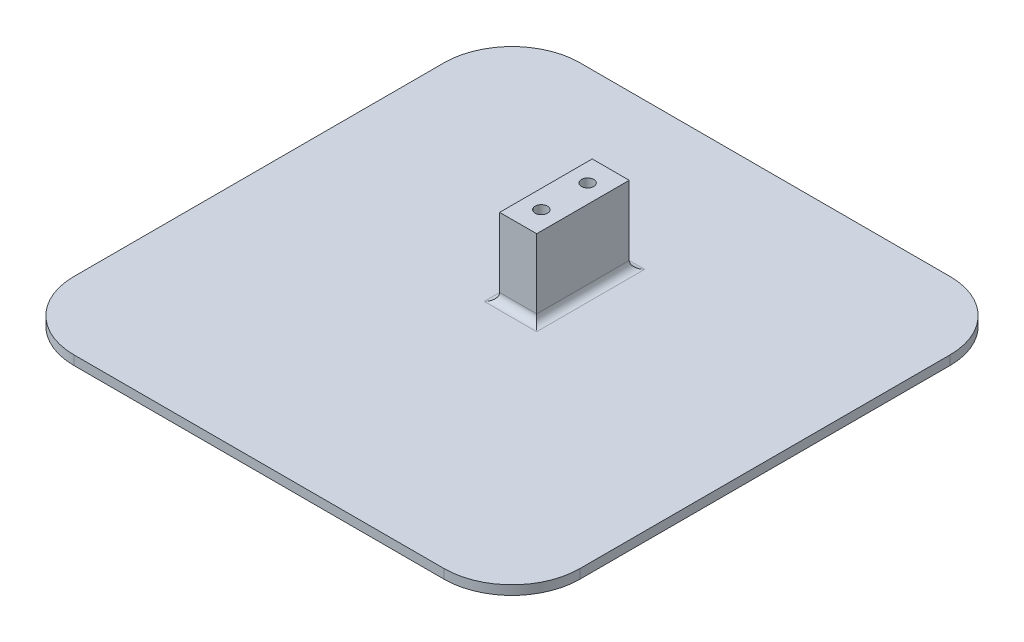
ISO-10303-21;
HEADER;
FILE_DESCRIPTION(('STEP AP214'),'2;1');
FILE_NAME('part.step','',(''),(''),'','','');
FILE_SCHEMA(('AUTOMOTIVE_DESIGN { 1 0 10303 214 1 1 1 1 }'));
ENDSEC;
DATA;
#1=APPLICATION_CONTEXT('core data for automotive mechanical design processes');
#2=APPLICATION_PROTOCOL_DEFINITION('international standard','automotive_design',2000,#1);
#3=PRODUCT_CONTEXT('',#1,'mechanical');
#4=PRODUCT('Part','Part','',(#3));
#5=PRODUCT_RELATED_PRODUCT_CATEGORY('part','',(#4));
#6=PRODUCT_DEFINITION_FORMATION('','',#4);
#7=PRODUCT_DEFINITION_CONTEXT('part definition',#1,'design');
#8=PRODUCT_DEFINITION('design','',#6,#7);
#9=PRODUCT_DEFINITION_SHAPE('','',#8);
#10=(LENGTH_UNIT() NAMED_UNIT(*) SI_UNIT(.MILLI.,.METRE.));
#11=(NAMED_UNIT(*) PLANE_ANGLE_UNIT() SI_UNIT($,.RADIAN.));
#12=(NAMED_UNIT(*) SI_UNIT($,.STERADIAN.) SOLID_ANGLE_UNIT());
#13=UNCERTAINTY_MEASURE_WITH_UNIT(LENGTH_MEASURE(1.E-05),#10,'distance_accuracy_value','');
#14=(GEOMETRIC_REPRESENTATION_CONTEXT(3) GLOBAL_UNCERTAINTY_ASSIGNED_CONTEXT((#13)) GLOBAL_UNIT_ASSIGNED_CONTEXT((#10,
#11,#12)) REPRESENTATION_CONTEXT('',''));
#15=CARTESIAN_POINT('',(0.,0.,0.));
#16=DIRECTION('',(0.,0.,1.));
#17=DIRECTION('',(1.,0.,0.));
#18=AXIS2_PLACEMENT_3D('',#15,#16,#17);
#19=CARTESIAN_POINT('',(0.,173.001,-9.5));
#20=DIRECTION('',(0.,-1.,0.));
#21=DIRECTION('',(0.,0.,-1.));
#22=AXIS2_PLACEMENT_3D('',#19,#20,#21);
#23=CYLINDRICAL_SURFACE('',#22,2.);
#24=CARTESIAN_POINT('',(0.,173.,-9.5));
#25=DIRECTION('',(0.,1.,0.));
#26=DIRECTION('',(0.,0.,1.));
#27=AXIS2_PLACEMENT_3D('',#24,#25,#26);
#28=CIRCLE('',#27,2.);
#29=CARTESIAN_POINT('',(0.,173.,-11.5));
#30=VERTEX_POINT('',#29);
#31=EDGE_CURVE('E236',#30,#30,#28,.T.);
#32=CARTESIAN_POINT('',(0.,150.,-9.5));
#33=DIRECTION('',(0.,-1.,0.));
#34=DIRECTION('',(0.,0.,-1.));
#35=AXIS2_PLACEMENT_3D('',#32,#33,#34);
#36=CIRCLE('',#35,2.);
#37=CARTESIAN_POINT('',(0.,150.,-11.5));
#38=VERTEX_POINT('',#37);
#39=EDGE_CURVE('E232',#38,#38,#36,.T.);
#40=CARTESIAN_POINT('',(0.,173.,-11.5));
#41=CARTESIAN_POINT('',(0.,172.760416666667,-11.5));
#42=CARTESIAN_POINT('',(0.,172.520833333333,-11.5));
#43=CARTESIAN_POINT('',(0.,172.041666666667,-11.5));
#44=CARTESIAN_POINT('',(0.,171.802083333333,-11.5));
#45=CARTESIAN_POINT('',(0.,171.322916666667,-11.5));
#46=CARTESIAN_POINT('',(0.,171.083333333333,-11.5));
#47=CARTESIAN_POINT('',(0.,170.604166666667,-11.5));
#48=CARTESIAN_POINT('',(0.,170.364583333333,-11.5));
#49=CARTESIAN_POINT('',(0.,169.885416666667,-11.5));
#50=CARTESIAN_POINT('',(0.,169.645833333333,-11.5));
#51=CARTESIAN_POINT('',(0.,169.166666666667,-11.5));
#52=CARTESIAN_POINT('',(0.,168.927083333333,-11.5));
#53=CARTESIAN_POINT('',(0.,168.447916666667,-11.5));
#54=CARTESIAN_POINT('',(0.,168.208333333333,-11.5));
#55=CARTESIAN_POINT('',(0.,167.729166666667,-11.5));
#56=CARTESIAN_POINT('',(0.,167.489583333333,-11.5));
#57=CARTESIAN_POINT('',(0.,167.010416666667,-11.5));
#58=CARTESIAN_POINT('',(0.,166.770833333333,-11.5));
#59=CARTESIAN_POINT('',(0.,166.291666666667,-11.5));
#60=CARTESIAN_POINT('',(0.,166.052083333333,-11.5));
#61=CARTESIAN_POINT('',(0.,165.572916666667,-11.5));
#62=CARTESIAN_POINT('',(0.,165.333333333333,-11.5));
#63=CARTESIAN_POINT('',(0.,164.854166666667,-11.5));
#64=CARTESIAN_POINT('',(0.,164.614583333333,-11.5));
#65=CARTESIAN_POINT('',(0.,164.135416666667,-11.5));
#66=CARTESIAN_POINT('',(0.,163.895833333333,-11.5));
#67=CARTESIAN_POINT('',(0.,163.416666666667,-11.5));
#68=CARTESIAN_POINT('',(0.,163.177083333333,-11.5));
#69=CARTESIAN_POINT('',(0.,162.697916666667,-11.5));
#70=CARTESIAN_POINT('',(0.,162.458333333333,-11.5));
#71=CARTESIAN_POINT('',(0.,161.979166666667,-11.5));
#72=CARTESIAN_POINT('',(0.,161.739583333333,-11.5));
#73=CARTESIAN_POINT('',(0.,161.260416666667,-11.5));
#74=CARTESIAN_POINT('',(0.,161.020833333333,-11.5));
#75=CARTESIAN_POINT('',(0.,160.541666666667,-11.5));
#76=CARTESIAN_POINT('',(0.,160.302083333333,-11.5));
#77=CARTESIAN_POINT('',(0.,159.822916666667,-11.5));
#78=CARTESIAN_POINT('',(0.,159.583333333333,-11.5));
#79=CARTESIAN_POINT('',(0.,159.104166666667,-11.5));
#80=CARTESIAN_POINT('',(0.,158.864583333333,-11.5));
#81=CARTESIAN_POINT('',(0.,158.385416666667,-11.5));
#82=CARTESIAN_POINT('',(0.,158.145833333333,-11.5));
#83=CARTESIAN_POINT('',(0.,157.666666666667,-11.5));
#84=CARTESIAN_POINT('',(0.,157.427083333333,-11.5));
#85=CARTESIAN_POINT('',(0.,156.947916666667,-11.5));
#86=CARTESIAN_POINT('',(0.,156.708333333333,-11.5));
#87=CARTESIAN_POINT('',(0.,156.229166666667,-11.5));
#88=CARTESIAN_POINT('',(0.,155.989583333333,-11.5));
#89=CARTESIAN_POINT('',(0.,155.510416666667,-11.5));
#90=CARTESIAN_POINT('',(0.,155.270833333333,-11.5));
#91=CARTESIAN_POINT('',(0.,154.791666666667,-11.5));
#92=CARTESIAN_POINT('',(0.,154.552083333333,-11.5));
#93=CARTESIAN_POINT('',(0.,154.072916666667,-11.5));
#94=CARTESIAN_POINT('',(0.,153.833333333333,-11.5));
#95=CARTESIAN_POINT('',(0.,153.354166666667,-11.5));
#96=CARTESIAN_POINT('',(0.,153.114583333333,-11.5));
#97=CARTESIAN_POINT('',(0.,152.635416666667,-11.5));
#98=CARTESIAN_POINT('',(0.,152.395833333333,-11.5));
#99=CARTESIAN_POINT('',(0.,151.916666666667,-11.5));
#100=CARTESIAN_POINT('',(0.,151.677083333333,-11.5));
#101=CARTESIAN_POINT('',(0.,151.197916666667,-11.5));
#102=CARTESIAN_POINT('',(0.,150.958333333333,-11.5));
#103=CARTESIAN_POINT('',(0.,150.479166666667,-11.5));
#104=CARTESIAN_POINT('',(0.,150.239583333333,-11.5));
#105=CARTESIAN_POINT('',(0.,150.,-11.5));
#106=B_SPLINE_CURVE_WITH_KNOTS('',3,(#40,#41,#42,#43,#44,#45,#46,#47,#48,#49,#50,#51,#52,#53,
#54,#55,#56,#57,#58,#59,#60,#61,#62,#63,#64,#65,#66,#67,#68,#69,#70,#71,#72,#73,#74,#75,#76,#77,
#78,#79,#80,#81,#82,#83,#84,#85,#86,#87,#88,#89,#90,#91,#92,#93,#94,#95,#96,#97,#98,#99,#100,
#101,#102,#103,#104,#105),.UNSPECIFIED.,.F.,.F.,(4,2,2,2,2,2,2,2,2,2,2,2,2,2,2,2,2,2,2,2,2,2,2,
2,2,2,2,2,2,2,2,2,4),(0.,0.71874999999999,1.43749999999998,2.15624999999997,2.87499999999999,
3.59374999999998,4.31249999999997,5.03124999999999,5.74999999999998,6.46874999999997,
7.18749999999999,7.90624999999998,8.62499999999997,9.34374999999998,10.0625,10.78125,11.5,
12.21875,12.9375,13.65625,14.375,15.09375,15.8125,16.53125,17.25,17.96875,18.6875,19.40625,
20.125,20.84375,21.5625,22.2812499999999,23.),.UNSPECIFIED.);
#107=EDGE_CURVE('BSEAM39',#30,#38,#106,.T.);
#108=ORIENTED_EDGE('',*,*,#31,.T.);
#109=ORIENTED_EDGE('',*,*,#39,.T.);
#110=ORIENTED_EDGE('',*,*,#107,.T.);
#111=ORIENTED_EDGE('',*,*,#107,.F.);
#112=EDGE_LOOP('',(#108,#110,#109,#111));
#113=FACE_BOUND('',#112,.T.);
#114=ADVANCED_FACE('F39',(#113),#23,.F.);
#115=CARTESIAN_POINT('',(0.,173.001,-24.5));
#116=DIRECTION('',(0.,-1.,0.));
#117=DIRECTION('',(0.,0.,-1.));
#118=AXIS2_PLACEMENT_3D('',#115,#116,#117);
#119=CYLINDRICAL_SURFACE('',#118,2.);
#120=CARTESIAN_POINT('',(0.,173.,-24.5));
#121=DIRECTION('',(0.,1.,0.));
#122=DIRECTION('',(0.,0.,1.));
#123=AXIS2_PLACEMENT_3D('',#120,#121,#122);
#124=CIRCLE('',#123,2.);
#125=CARTESIAN_POINT('',(0.,173.,-26.5));
#126=VERTEX_POINT('',#125);
#127=EDGE_CURVE('E161',#126,#126,#124,.T.);
#128=CARTESIAN_POINT('',(0.,150.,-24.5));
#129=DIRECTION('',(0.,-1.,0.));
#130=DIRECTION('',(0.,0.,-1.));
#131=AXIS2_PLACEMENT_3D('',#128,#129,#130);
#132=CIRCLE('',#131,2.);
#133=CARTESIAN_POINT('',(0.,150.,-26.5));
#134=VERTEX_POINT('',#133);
#135=EDGE_CURVE('E229',#134,#134,#132,.T.);
#136=CARTESIAN_POINT('',(0.,173.,-26.5));
#137=CARTESIAN_POINT('',(0.,172.760416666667,-26.5));
#138=CARTESIAN_POINT('',(0.,172.520833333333,-26.5));
#139=CARTESIAN_POINT('',(0.,172.041666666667,-26.5));
#140=CARTESIAN_POINT('',(0.,171.802083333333,-26.5));
#141=CARTESIAN_POINT('',(0.,171.322916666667,-26.5));
#142=CARTESIAN_POINT('',(0.,171.083333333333,-26.5));
#143=CARTESIAN_POINT('',(0.,170.604166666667,-26.5));
#144=CARTESIAN_POINT('',(0.,170.364583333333,-26.5));
#145=CARTESIAN_POINT('',(0.,169.885416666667,-26.5));
#146=CARTESIAN_POINT('',(0.,169.645833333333,-26.5));
#147=CARTESIAN_POINT('',(0.,169.166666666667,-26.5));
#148=CARTESIAN_POINT('',(0.,168.927083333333,-26.5));
#149=CARTESIAN_POINT('',(0.,168.447916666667,-26.5));
#150=CARTESIAN_POINT('',(0.,168.208333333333,-26.5));
#151=CARTESIAN_POINT('',(0.,167.729166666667,-26.5));
#152=CARTESIAN_POINT('',(0.,167.489583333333,-26.5));
#153=CARTESIAN_POINT('',(0.,167.010416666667,-26.5));
#154=CARTESIAN_POINT('',(0.,166.770833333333,-26.5));
#155=CARTESIAN_POINT('',(0.,166.291666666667,-26.5));
#156=CARTESIAN_POINT('',(0.,166.052083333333,-26.5));
#157=CARTESIAN_POINT('',(0.,165.572916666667,-26.5));
#158=CARTESIAN_POINT('',(0.,165.333333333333,-26.5));
#159=CARTESIAN_POINT('',(0.,164.854166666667,-26.5));
#160=CARTESIAN_POINT('',(0.,164.614583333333,-26.5));
#161=CARTESIAN_POINT('',(0.,164.135416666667,-26.5));
#162=CARTESIAN_POINT('',(0.,163.895833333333,-26.5));
#163=CARTESIAN_POINT('',(0.,163.416666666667,-26.5));
#164=CARTESIAN_POINT('',(0.,163.177083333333,-26.5));
#165=CARTESIAN_POINT('',(0.,162.697916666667,-26.5));
#166=CARTESIAN_POINT('',(0.,162.458333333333,-26.5));
#167=CARTESIAN_POINT('',(0.,161.979166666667,-26.5));
#168=CARTESIAN_POINT('',(0.,161.739583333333,-26.5));
#169=CARTESIAN_POINT('',(0.,161.260416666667,-26.5));
#170=CARTESIAN_POINT('',(0.,161.020833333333,-26.5));
#171=CARTESIAN_POINT('',(0.,160.541666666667,-26.5));
#172=CARTESIAN_POINT('',(0.,160.302083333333,-26.5));
#173=CARTESIAN_POINT('',(0.,159.822916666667,-26.5));
#174=CARTESIAN_POINT('',(0.,159.583333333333,-26.5));
#175=CARTESIAN_POINT('',(0.,159.104166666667,-26.5));
#176=CARTESIAN_POINT('',(0.,158.864583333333,-26.5));
#177=CARTESIAN_POINT('',(0.,158.385416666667,-26.5));
#178=CARTESIAN_POINT('',(0.,158.145833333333,-26.5));
#179=CARTESIAN_POINT('',(0.,157.666666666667,-26.5));
#180=CARTESIAN_POINT('',(0.,157.427083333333,-26.5));
#181=CARTESIAN_POINT('',(0.,156.947916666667,-26.5));
#182=CARTESIAN_POINT('',(0.,156.708333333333,-26.5));
#183=CARTESIAN_POINT('',(0.,156.229166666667,-26.5));
#184=CARTESIAN_POINT('',(0.,155.989583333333,-26.5));
#185=CARTESIAN_POINT('',(0.,155.510416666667,-26.5));
#186=CARTESIAN_POINT('',(0.,155.270833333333,-26.5));
#187=CARTESIAN_POINT('',(0.,154.791666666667,-26.5));
#188=CARTESIAN_POINT('',(0.,154.552083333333,-26.5));
#189=CARTESIAN_POINT('',(0.,154.072916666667,-26.5));
#190=CARTESIAN_POINT('',(0.,153.833333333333,-26.5));
#191=CARTESIAN_POINT('',(0.,153.354166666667,-26.5));
#192=CARTESIAN_POINT('',(0.,153.114583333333,-26.5));
#193=CARTESIAN_POINT('',(0.,152.635416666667,-26.5));
#194=CARTESIAN_POINT('',(0.,152.395833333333,-26.5));
#195=CARTESIAN_POINT('',(0.,151.916666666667,-26.5));
#196=CARTESIAN_POINT('',(0.,151.677083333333,-26.5));
#197=CARTESIAN_POINT('',(0.,151.197916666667,-26.5));
#198=CARTESIAN_POINT('',(0.,150.958333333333,-26.5));
#199=CARTESIAN_POINT('',(0.,150.479166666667,-26.5));
#200=CARTESIAN_POINT('',(0.,150.239583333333,-26.5));
#201=CARTESIAN_POINT('',(0.,150.,-26.5));
#202=B_SPLINE_CURVE_WITH_KNOTS('',3,(#136,#137,#138,#139,#140,#141,#142,#143,#144,#145,#146,
#147,#148,#149,#150,#151,#152,#153,#154,#155,#156,#157,#158,#159,#160,#161,#162,#163,#164,#165,
#166,#167,#168,#169,#170,#171,#172,#173,#174,#175,#176,#177,#178,#179,#180,#181,#182,#183,#184,
#185,#186,#187,#188,#189,#190,#191,#192,#193,#194,#195,#196,#197,#198,#199,#200,#201),
.UNSPECIFIED.,.F.,.F.,(4,2,2,2,2,2,2,2,2,2,2,2,2,2,2,2,2,2,2,2,2,2,2,2,2,2,2,2,2,2,2,2,4),(0.,
0.71874999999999,1.43749999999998,2.15624999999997,2.87499999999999,3.59374999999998,
4.31249999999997,5.03124999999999,5.74999999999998,6.46874999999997,7.18749999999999,
7.90624999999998,8.62499999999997,9.34374999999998,10.0625,10.78125,11.5,12.21875,12.9375,
13.65625,14.375,15.09375,15.8125,16.53125,17.25,17.96875,18.6875,19.40625,20.125,20.84375,
21.5625,22.2812499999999,23.),.UNSPECIFIED.);
#203=EDGE_CURVE('BSEAM298',#126,#134,#202,.T.);
#204=ORIENTED_EDGE('',*,*,#127,.T.);
#205=ORIENTED_EDGE('',*,*,#135,.T.);
#206=ORIENTED_EDGE('',*,*,#203,.T.);
#207=ORIENTED_EDGE('',*,*,#203,.F.);
#208=EDGE_LOOP('',(#204,#206,#205,#207));
#209=FACE_BOUND('',#208,.T.);
#210=ADVANCED_FACE('F298',(#209),#119,.F.);
#211=CARTESIAN_POINT('',(-60.,148.,-60.));
#212=DIRECTION('',(0.,1.,0.));
#213=DIRECTION('',(0.,0.,1.));
#214=AXIS2_PLACEMENT_3D('',#211,#212,#213);
#215=PLANE('',#214);
#216=DIRECTION('',(-1.,0.,0.));
#217=VECTOR('',#216,1.);
#218=CARTESIAN_POINT('',(-60.,148.,-34.5));
#219=LINE('',#218,#217);
#220=CARTESIAN_POINT('',(-8.5,148.,-34.5));
#221=VERTEX_POINT('',#220);
#222=CARTESIAN_POINT('',(8.5,148.,-34.5));
#223=VERTEX_POINT('',#222);
#224=EDGE_CURVE('E242',#221,#223,#219,.F.);
#225=ORIENTED_EDGE('',*,*,#224,.T.);
#226=DIRECTION('',(0.,0.,-1.));
#227=VECTOR('',#226,1.);
#228=CARTESIAN_POINT('',(8.50000000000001,148.,-60.));
#229=LINE('',#228,#227);
#230=CARTESIAN_POINT('',(8.5,148.,0.499999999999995));
#231=VERTEX_POINT('',#230);
#232=EDGE_CURVE('E245',#223,#231,#229,.F.);
#233=ORIENTED_EDGE('',*,*,#232,.T.);
#234=DIRECTION('',(1.,0.,0.));
#235=VECTOR('',#234,1.);
#236=CARTESIAN_POINT('',(-60.,148.,0.499999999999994));
#237=LINE('',#236,#235);
#238=CARTESIAN_POINT('',(-8.5,148.,0.499999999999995));
#239=VERTEX_POINT('',#238);
#240=EDGE_CURVE('E240',#231,#239,#237,.F.);
#241=ORIENTED_EDGE('',*,*,#240,.T.);
#242=DIRECTION('',(0.,0.,1.));
#243=VECTOR('',#242,1.);
#244=CARTESIAN_POINT('',(-8.5,148.,-60.));
#245=LINE('',#244,#243);
#246=EDGE_CURVE('E238',#239,#221,#245,.F.);
#247=ORIENTED_EDGE('',*,*,#246,.T.);
#248=EDGE_LOOP('',(#225,#233,#241,#247));
#249=FACE_BOUND('',#248,.T.);
#250=CARTESIAN_POINT('',(-60.,148.,-60.));
#251=DIRECTION('',(0.,1.,0.));
#252=DIRECTION('',(0.,0.,1.));
#253=AXIS2_PLACEMENT_3D('',#250,#251,#252);
#254=CIRCLE('',#253,22.);
#255=CARTESIAN_POINT('',(-60.,148.,-82.));
#256=VERTEX_POINT('',#255);
#257=CARTESIAN_POINT('',(-82.,148.,-60.));
#258=VERTEX_POINT('',#257);
#259=EDGE_CURVE('E174',#256,#258,#254,.T.);
#260=ORIENTED_EDGE('',*,*,#259,.T.);
#261=DIRECTION('',(0.,0.,1.));
#262=VECTOR('',#261,1.);
#263=CARTESIAN_POINT('',(-82.,148.,-60.));
#264=LINE('',#263,#262);
#265=CARTESIAN_POINT('',(-82.,148.,60.));
#266=VERTEX_POINT('',#265);
#267=EDGE_CURVE('E177',#258,#266,#264,.T.);
#268=ORIENTED_EDGE('',*,*,#267,.T.);
#269=CARTESIAN_POINT('',(-60.,148.,60.));
#270=DIRECTION('',(0.,1.,0.));
#271=DIRECTION('',(0.,0.,1.));
#272=AXIS2_PLACEMENT_3D('',#269,#270,#271);
#273=CIRCLE('',#272,22.);
#274=CARTESIAN_POINT('',(-60.,148.,82.));
#275=VERTEX_POINT('',#274);
#276=EDGE_CURVE('E180',#266,#275,#273,.T.);
#277=ORIENTED_EDGE('',*,*,#276,.T.);
#278=DIRECTION('',(1.,0.,0.));
#279=VECTOR('',#278,1.);
#280=CARTESIAN_POINT('',(59.9999999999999,148.,82.));
#281=LINE('',#280,#279);
#282=CARTESIAN_POINT('',(59.9999999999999,148.,82.));
#283=VERTEX_POINT('',#282);
#284=EDGE_CURVE('E182',#275,#283,#281,.T.);
#285=ORIENTED_EDGE('',*,*,#284,.T.);
#286=CARTESIAN_POINT('',(60.,148.,60.));
#287=DIRECTION('',(0.,1.,0.));
#288=DIRECTION('',(0.,0.,1.));
#289=AXIS2_PLACEMENT_3D('',#286,#287,#288);
#290=CIRCLE('',#289,22.);
#291=CARTESIAN_POINT('',(82.,148.,60.));
#292=VERTEX_POINT('',#291);
#293=EDGE_CURVE('E184',#283,#292,#290,.T.);
#294=ORIENTED_EDGE('',*,*,#293,.T.);
#295=DIRECTION('',(0.,0.,-1.));
#296=VECTOR('',#295,1.);
#297=CARTESIAN_POINT('',(82.,148.,-60.));
#298=LINE('',#297,#296);
#299=CARTESIAN_POINT('',(82.,148.,-60.));
#300=VERTEX_POINT('',#299);
#301=EDGE_CURVE('E186',#292,#300,#298,.T.);
#302=ORIENTED_EDGE('',*,*,#301,.T.);
#303=CARTESIAN_POINT('',(60.,148.,-60.));
#304=DIRECTION('',(0.,1.,0.));
#305=DIRECTION('',(0.,0.,1.));
#306=AXIS2_PLACEMENT_3D('',#303,#304,#305);
#307=CIRCLE('',#306,22.);
#308=CARTESIAN_POINT('',(60.,148.,-82.));
#309=VERTEX_POINT('',#308);
#310=EDGE_CURVE('E188',#300,#309,#307,.T.);
#311=ORIENTED_EDGE('',*,*,#310,.T.);
#312=DIRECTION('',(-1.,0.,0.));
#313=VECTOR('',#312,1.);
#314=CARTESIAN_POINT('',(-60.,148.,-82.));
#315=LINE('',#314,#313);
#316=EDGE_CURVE('E190',#309,#256,#315,.T.);
#317=ORIENTED_EDGE('',*,*,#316,.T.);
#318=EDGE_LOOP('',(#260,#268,#277,#285,#294,#302,#311,#317));
#319=FACE_BOUND('',#318,.T.);
#320=ADVANCED_FACE('F304',(#249,#319),#215,.T.);
#321=CARTESIAN_POINT('',(-60.,145.,-60.));
#322=DIRECTION('',(0.,1.,0.));
#323=DIRECTION('',(0.,0.,1.));
#324=AXIS2_PLACEMENT_3D('',#321,#322,#323);
#325=PLANE('',#324);
#326=CARTESIAN_POINT('',(0.,145.,-9.5));
#327=DIRECTION('',(0.,-1.,0.));
#328=DIRECTION('',(0.,0.,-1.));
#329=AXIS2_PLACEMENT_3D('',#326,#327,#328);
#330=CIRCLE('',#329,4.25);
#331=CARTESIAN_POINT('',(0.,145.,-13.75));
#332=VERTEX_POINT('',#331);
#333=EDGE_CURVE('E268',#332,#332,#330,.T.);
#334=ORIENTED_EDGE('',*,*,#333,.F.);
#335=EDGE_LOOP('',(#334));
#336=FACE_BOUND('',#335,.T.);
#337=CARTESIAN_POINT('',(0.,145.,-24.5));
#338=DIRECTION('',(0.,-1.,0.));
#339=DIRECTION('',(0.,0.,-1.));
#340=AXIS2_PLACEMENT_3D('',#337,#338,#339);
#341=CIRCLE('',#340,4.25);
#342=CARTESIAN_POINT('',(0.,145.,-28.75));
#343=VERTEX_POINT('',#342);
#344=EDGE_CURVE('E258',#343,#343,#341,.T.);
#345=ORIENTED_EDGE('',*,*,#344,.F.);
#346=EDGE_LOOP('',(#345));
#347=FACE_BOUND('',#346,.T.);
#348=CARTESIAN_POINT('',(60.,145.,60.));
#349=DIRECTION('',(0.,1.,0.));
#350=DIRECTION('',(0.,0.,1.));
#351=AXIS2_PLACEMENT_3D('',#348,#349,#350);
#352=CIRCLE('',#351,22.);
#353=CARTESIAN_POINT('',(59.9999999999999,145.,82.));
#354=VERTEX_POINT('',#353);
#355=CARTESIAN_POINT('',(82.,145.,60.));
#356=VERTEX_POINT('',#355);
#357=EDGE_CURVE('E198',#354,#356,#352,.T.);
#358=ORIENTED_EDGE('',*,*,#357,.F.);
#359=DIRECTION('',(1.,0.,0.));
#360=VECTOR('',#359,1.);
#361=CARTESIAN_POINT('',(59.9999999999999,145.,82.));
#362=LINE('',#361,#360);
#363=CARTESIAN_POINT('',(-60.,145.,82.));
#364=VERTEX_POINT('',#363);
#365=EDGE_CURVE('E196',#364,#354,#362,.T.);
#366=ORIENTED_EDGE('',*,*,#365,.F.);
#367=CARTESIAN_POINT('',(-60.,145.,60.));
#368=DIRECTION('',(0.,1.,0.));
#369=DIRECTION('',(0.,0.,1.));
#370=AXIS2_PLACEMENT_3D('',#367,#368,#369);
#371=CIRCLE('',#370,22.);
#372=CARTESIAN_POINT('',(-82.,145.,60.));
#373=VERTEX_POINT('',#372);
#374=EDGE_CURVE('E194',#373,#364,#371,.T.);
#375=ORIENTED_EDGE('',*,*,#374,.F.);
#376=DIRECTION('',(0.,0.,1.));
#377=VECTOR('',#376,1.);
#378=CARTESIAN_POINT('',(-82.,145.,-60.));
#379=LINE('',#378,#377);
#380=CARTESIAN_POINT('',(-82.,145.,-60.));
#381=VERTEX_POINT('',#380);
#382=EDGE_CURVE('E168',#381,#373,#379,.T.);
#383=ORIENTED_EDGE('',*,*,#382,.F.);
#384=CARTESIAN_POINT('',(-60.,145.,-60.));
#385=DIRECTION('',(0.,1.,0.));
#386=DIRECTION('',(0.,0.,1.));
#387=AXIS2_PLACEMENT_3D('',#384,#385,#386);
#388=CIRCLE('',#387,22.);
#389=CARTESIAN_POINT('',(-60.,145.,-82.));
#390=VERTEX_POINT('',#389);
#391=EDGE_CURVE('E165',#390,#381,#388,.T.);
#392=ORIENTED_EDGE('',*,*,#391,.F.);
#393=DIRECTION('',(-1.,0.,0.));
#394=VECTOR('',#393,1.);
#395=CARTESIAN_POINT('',(-60.,145.,-82.));
#396=LINE('',#395,#394);
#397=CARTESIAN_POINT('',(60.,145.,-82.));
#398=VERTEX_POINT('',#397);
#399=EDGE_CURVE('E178',#398,#390,#396,.T.);
#400=ORIENTED_EDGE('',*,*,#399,.F.);
#401=CARTESIAN_POINT('',(60.,145.,-60.));
#402=DIRECTION('',(0.,1.,0.));
#403=DIRECTION('',(0.,0.,1.));
#404=AXIS2_PLACEMENT_3D('',#401,#402,#403);
#405=CIRCLE('',#404,22.);
#406=CARTESIAN_POINT('',(82.,145.,-60.));
#407=VERTEX_POINT('',#406);
#408=EDGE_CURVE('E202',#407,#398,#405,.T.);
#409=ORIENTED_EDGE('',*,*,#408,.F.);
#410=DIRECTION('',(0.,0.,-1.));
#411=VECTOR('',#410,1.);
#412=CARTESIAN_POINT('',(82.,145.,-60.));
#413=LINE('',#412,#411);
#414=EDGE_CURVE('E200',#356,#407,#413,.T.);
#415=ORIENTED_EDGE('',*,*,#414,.F.);
#416=EDGE_LOOP('',(#358,#366,#375,#383,#392,#400,#409,#415));
#417=FACE_BOUND('',#416,.T.);
#418=ADVANCED_FACE('F350',(#336,#347,#417),#325,.F.);
#419=CARTESIAN_POINT('',(-60.,148.,-60.));
#420=DIRECTION('',(0.,-1.,0.));
#421=DIRECTION('',(0.,0.,-1.));
#422=AXIS2_PLACEMENT_3D('',#419,#420,#421);
#423=CYLINDRICAL_SURFACE('',#422,22.);
#424=ORIENTED_EDGE('',*,*,#391,.T.);
#425=DIRECTION('',(0.,-1.,0.));
#426=VECTOR('',#425,1.);
#427=CARTESIAN_POINT('',(-82.,148.,-60.));
#428=LINE('',#427,#426);
#429=EDGE_CURVE('E225',#258,#381,#428,.T.);
#430=ORIENTED_EDGE('',*,*,#429,.F.);
#431=ORIENTED_EDGE('',*,*,#259,.F.);
#432=DIRECTION('',(0.,-1.,0.));
#433=VECTOR('',#432,1.);
#434=CARTESIAN_POINT('',(-60.,148.,-82.));
#435=LINE('',#434,#433);
#436=EDGE_CURVE('E191',#256,#390,#435,.T.);
#437=ORIENTED_EDGE('',*,*,#436,.T.);
#438=EDGE_LOOP('',(#424,#430,#431,#437));
#439=FACE_BOUND('',#438,.T.);
#440=ADVANCED_FACE('F353',(#439),#423,.T.);
#441=CARTESIAN_POINT('',(-82.,148.,-60.));
#442=DIRECTION('',(1.,0.,0.));
#443=DIRECTION('',(0.,0.,-1.));
#444=AXIS2_PLACEMENT_3D('',#441,#442,#443);
#445=PLANE('',#444);
#446=ORIENTED_EDGE('',*,*,#382,.T.);
#447=DIRECTION('',(0.,-1.,0.));
#448=VECTOR('',#447,1.);
#449=CARTESIAN_POINT('',(-82.,148.,60.));
#450=LINE('',#449,#448);
#451=EDGE_CURVE('E222',#266,#373,#450,.T.);
#452=ORIENTED_EDGE('',*,*,#451,.F.);
#453=ORIENTED_EDGE('',*,*,#267,.F.);
#454=ORIENTED_EDGE('',*,*,#429,.T.);
#455=EDGE_LOOP('',(#446,#452,#453,#454));
#456=FACE_BOUND('',#455,.T.);
#457=ADVANCED_FACE('F385',(#456),#445,.F.);
#458=CARTESIAN_POINT('',(-60.,148.,60.));
#459=DIRECTION('',(0.,-1.,0.));
#460=DIRECTION('',(0.,0.,-1.));
#461=AXIS2_PLACEMENT_3D('',#458,#459,#460);
#462=CYLINDRICAL_SURFACE('',#461,22.);
#463=ORIENTED_EDGE('',*,*,#374,.T.);
#464=DIRECTION('',(0.,-1.,0.));
#465=VECTOR('',#464,1.);
#466=CARTESIAN_POINT('',(-60.,148.,82.));
#467=LINE('',#466,#465);
#468=EDGE_CURVE('E219',#275,#364,#467,.T.);
#469=ORIENTED_EDGE('',*,*,#468,.F.);
#470=ORIENTED_EDGE('',*,*,#276,.F.);
#471=ORIENTED_EDGE('',*,*,#451,.T.);
#472=EDGE_LOOP('',(#463,#469,#470,#471));
#473=FACE_BOUND('',#472,.T.);
#474=ADVANCED_FACE('F379',(#473),#462,.T.);
#475=CARTESIAN_POINT('',(59.9999999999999,148.,82.));
#476=DIRECTION('',(0.,0.,-1.));
#477=DIRECTION('',(-1.,0.,0.));
#478=AXIS2_PLACEMENT_3D('',#475,#476,#477);
#479=PLANE('',#478);
#480=ORIENTED_EDGE('',*,*,#365,.T.);
#481=DIRECTION('',(0.,-1.,0.));
#482=VECTOR('',#481,1.);
#483=CARTESIAN_POINT('',(59.9999999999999,148.,82.));
#484=LINE('',#483,#482);
#485=EDGE_CURVE('E216',#283,#354,#484,.T.);
#486=ORIENTED_EDGE('',*,*,#485,.F.);
#487=ORIENTED_EDGE('',*,*,#284,.F.);
#488=ORIENTED_EDGE('',*,*,#468,.T.);
#489=EDGE_LOOP('',(#480,#486,#487,#488));
#490=FACE_BOUND('',#489,.T.);
#491=ADVANCED_FACE('F377',(#490),#479,.F.);
#492=CARTESIAN_POINT('',(60.,148.,60.));
#493=DIRECTION('',(0.,-1.,0.));
#494=DIRECTION('',(0.,0.,-1.));
#495=AXIS2_PLACEMENT_3D('',#492,#493,#494);
#496=CYLINDRICAL_SURFACE('',#495,22.);
#497=ORIENTED_EDGE('',*,*,#357,.T.);
#498=DIRECTION('',(0.,-1.,0.));
#499=VECTOR('',#498,1.);
#500=CARTESIAN_POINT('',(82.,148.,60.));
#501=LINE('',#500,#499);
#502=EDGE_CURVE('E213',#292,#356,#501,.T.);
#503=ORIENTED_EDGE('',*,*,#502,.F.);
#504=ORIENTED_EDGE('',*,*,#293,.F.);
#505=ORIENTED_EDGE('',*,*,#485,.T.);
#506=EDGE_LOOP('',(#497,#503,#504,#505));
#507=FACE_BOUND('',#506,.T.);
#508=ADVANCED_FACE('F363',(#507),#496,.T.);
#509=CARTESIAN_POINT('',(82.,148.,-60.));
#510=DIRECTION('',(-1.,0.,0.));
#511=DIRECTION('',(0.,0.,1.));
#512=AXIS2_PLACEMENT_3D('',#509,#510,#511);
#513=PLANE('',#512);
#514=ORIENTED_EDGE('',*,*,#414,.T.);
#515=DIRECTION('',(0.,-1.,0.));
#516=VECTOR('',#515,1.);
#517=CARTESIAN_POINT('',(82.,148.,-60.));
#518=LINE('',#517,#516);
#519=EDGE_CURVE('E210',#300,#407,#518,.T.);
#520=ORIENTED_EDGE('',*,*,#519,.F.);
#521=ORIENTED_EDGE('',*,*,#301,.F.);
#522=ORIENTED_EDGE('',*,*,#502,.T.);
#523=EDGE_LOOP('',(#514,#520,#521,#522));
#524=FACE_BOUND('',#523,.T.);
#525=ADVANCED_FACE('F368',(#524),#513,.F.);
#526=CARTESIAN_POINT('',(60.,148.,-60.));
#527=DIRECTION('',(0.,-1.,0.));
#528=DIRECTION('',(0.,0.,-1.));
#529=AXIS2_PLACEMENT_3D('',#526,#527,#528);
#530=CYLINDRICAL_SURFACE('',#529,22.);
#531=ORIENTED_EDGE('',*,*,#408,.T.);
#532=DIRECTION('',(0.,-1.,0.));
#533=VECTOR('',#532,1.);
#534=CARTESIAN_POINT('',(60.,148.,-82.));
#535=LINE('',#534,#533);
#536=EDGE_CURVE('E207',#309,#398,#535,.T.);
#537=ORIENTED_EDGE('',*,*,#536,.F.);
#538=ORIENTED_EDGE('',*,*,#310,.F.);
#539=ORIENTED_EDGE('',*,*,#519,.T.);
#540=EDGE_LOOP('',(#531,#537,#538,#539));
#541=FACE_BOUND('',#540,.T.);
#542=ADVANCED_FACE('F393',(#541),#530,.T.);
#543=CARTESIAN_POINT('',(-60.,148.,-82.));
#544=DIRECTION('',(0.,0.,1.));
#545=DIRECTION('',(1.,0.,0.));
#546=AXIS2_PLACEMENT_3D('',#543,#544,#545);
#547=PLANE('',#546);
#548=ORIENTED_EDGE('',*,*,#399,.T.);
#549=ORIENTED_EDGE('',*,*,#436,.F.);
#550=ORIENTED_EDGE('',*,*,#316,.F.);
#551=ORIENTED_EDGE('',*,*,#536,.T.);
#552=EDGE_LOOP('',(#548,#549,#550,#551));
#553=FACE_BOUND('',#552,.T.);
#554=ADVANCED_FACE('F391',(#553),#547,.F.);
#555=CARTESIAN_POINT('',(6.,173.,-32.));
#556=DIRECTION('',(-1.,0.,0.));
#557=DIRECTION('',(0.,0.,1.));
#558=AXIS2_PLACEMENT_3D('',#555,#556,#557);
#559=PLANE('',#558);
#560=DIRECTION('',(0.,-1.,0.));
#561=VECTOR('',#560,1.);
#562=CARTESIAN_POINT('',(6.,173.,-2.00000000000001));
#563=LINE('',#562,#561);
#564=CARTESIAN_POINT('',(6.,173.,-2.00000000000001));
#565=VERTEX_POINT('',#564);
#566=CARTESIAN_POINT('',(6.,150.5,-2.00000000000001));
#567=VERTEX_POINT('',#566);
#568=EDGE_CURVE('E278',#565,#567,#563,.T.);
#569=ORIENTED_EDGE('',*,*,#568,.T.);
#570=DIRECTION('',(0.,0.,-1.));
#571=VECTOR('',#570,1.);
#572=CARTESIAN_POINT('',(6.,150.5,-32.));
#573=LINE('',#572,#571);
#574=CARTESIAN_POINT('',(6.,150.5,-32.));
#575=VERTEX_POINT('',#574);
#576=EDGE_CURVE('E48',#567,#575,#573,.T.);
#577=ORIENTED_EDGE('',*,*,#576,.T.);
#578=DIRECTION('',(0.,-1.,0.));
#579=VECTOR('',#578,1.);
#580=CARTESIAN_POINT('',(6.,173.,-32.));
#581=LINE('',#580,#579);
#582=CARTESIAN_POINT('',(6.,173.,-32.));
#583=VERTEX_POINT('',#582);
#584=EDGE_CURVE('E148',#583,#575,#581,.T.);
#585=ORIENTED_EDGE('',*,*,#584,.F.);
#586=DIRECTION('',(0.,0.,-1.));
#587=VECTOR('',#586,1.);
#588=CARTESIAN_POINT('',(6.,173.,-32.));
#589=LINE('',#588,#587);
#590=EDGE_CURVE('E154',#565,#583,#589,.T.);
#591=ORIENTED_EDGE('',*,*,#590,.F.);
#592=EDGE_LOOP('',(#569,#577,#585,#591));
#593=FACE_BOUND('',#592,.T.);
#594=ADVANCED_FACE('F163',(#593),#559,.F.);
#595=CARTESIAN_POINT('',(-6.,173.,-32.));
#596=DIRECTION('',(0.,0.,1.));
#597=DIRECTION('',(1.,0.,0.));
#598=AXIS2_PLACEMENT_3D('',#595,#596,#597);
#599=PLANE('',#598);
#600=ORIENTED_EDGE('',*,*,#584,.T.);
#601=DIRECTION('',(-1.,0.,0.));
#602=VECTOR('',#601,1.);
#603=CARTESIAN_POINT('',(-6.,150.5,-32.));
#604=LINE('',#603,#602);
#605=CARTESIAN_POINT('',(-6.,150.5,-32.));
#606=VERTEX_POINT('',#605);
#607=EDGE_CURVE('E228',#575,#606,#604,.T.);
#608=ORIENTED_EDGE('',*,*,#607,.T.);
#609=DIRECTION('',(0.,-1.,0.));
#610=VECTOR('',#609,1.);
#611=CARTESIAN_POINT('',(-6.,173.,-32.));
#612=LINE('',#611,#610);
#613=CARTESIAN_POINT('',(-6.,173.,-32.));
#614=VERTEX_POINT('',#613);
#615=EDGE_CURVE('E150',#614,#606,#612,.T.);
#616=ORIENTED_EDGE('',*,*,#615,.F.);
#617=DIRECTION('',(-1.,0.,0.));
#618=VECTOR('',#617,1.);
#619=CARTESIAN_POINT('',(-6.,173.,-32.));
#620=LINE('',#619,#618);
#621=EDGE_CURVE('E143',#583,#614,#620,.T.);
#622=ORIENTED_EDGE('',*,*,#621,.F.);
#623=EDGE_LOOP('',(#600,#608,#616,#622));
#624=FACE_BOUND('',#623,.T.);
#625=ADVANCED_FACE('F145',(#624),#599,.F.);
#626=CARTESIAN_POINT('',(-6.,173.,-32.));
#627=DIRECTION('',(1.,0.,0.));
#628=DIRECTION('',(0.,0.,-1.));
#629=AXIS2_PLACEMENT_3D('',#626,#627,#628);
#630=PLANE('',#629);
#631=ORIENTED_EDGE('',*,*,#615,.T.);
#632=DIRECTION('',(0.,0.,1.));
#633=VECTOR('',#632,1.);
#634=CARTESIAN_POINT('',(-6.,150.5,-32.));
#635=LINE('',#634,#633);
#636=CARTESIAN_POINT('',(-6.,150.5,-2.00000000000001));
#637=VERTEX_POINT('',#636);
#638=EDGE_CURVE('E11',#606,#637,#635,.T.);
#639=ORIENTED_EDGE('',*,*,#638,.T.);
#640=DIRECTION('',(0.,-1.,0.));
#641=VECTOR('',#640,1.);
#642=CARTESIAN_POINT('',(-6.,173.,-2.00000000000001));
#643=LINE('',#642,#641);
#644=CARTESIAN_POINT('',(-6.,173.,-2.00000000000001));
#645=VERTEX_POINT('',#644);
#646=EDGE_CURVE('E170',#645,#637,#643,.T.);
#647=ORIENTED_EDGE('',*,*,#646,.F.);
#648=DIRECTION('',(0.,0.,1.));
#649=VECTOR('',#648,1.);
#650=CARTESIAN_POINT('',(-6.,173.,-32.));
#651=LINE('',#650,#649);
#652=EDGE_CURVE('E153',#614,#645,#651,.T.);
#653=ORIENTED_EDGE('',*,*,#652,.F.);
#654=EDGE_LOOP('',(#631,#639,#647,#653));
#655=FACE_BOUND('',#654,.T.);
#656=ADVANCED_FACE('F288',(#655),#630,.F.);
#657=CARTESIAN_POINT('',(-6.,173.,-2.00000000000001));
#658=DIRECTION('',(0.,0.,-1.));
#659=DIRECTION('',(-1.,0.,0.));
#660=AXIS2_PLACEMENT_3D('',#657,#658,#659);
#661=PLANE('',#660);
#662=ORIENTED_EDGE('',*,*,#646,.T.);
#663=DIRECTION('',(1.,0.,0.));
#664=VECTOR('',#663,1.);
#665=CARTESIAN_POINT('',(-6.,150.5,-2.00000000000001));
#666=LINE('',#665,#664);
#667=EDGE_CURVE('E61',#637,#567,#666,.T.);
#668=ORIENTED_EDGE('',*,*,#667,.T.);
#669=ORIENTED_EDGE('',*,*,#568,.F.);
#670=DIRECTION('',(1.,0.,0.));
#671=VECTOR('',#670,1.);
#672=CARTESIAN_POINT('',(-6.,173.,-2.00000000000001));
#673=LINE('',#672,#671);
#674=EDGE_CURVE('E159',#645,#565,#673,.T.);
#675=ORIENTED_EDGE('',*,*,#674,.F.);
#676=EDGE_LOOP('',(#662,#668,#669,#675));
#677=FACE_BOUND('',#676,.T.);
#678=ADVANCED_FACE('F279',(#677),#661,.F.);
#679=CARTESIAN_POINT('',(0.,173.,0.));
#680=DIRECTION('',(0.,1.,0.));
#681=DIRECTION('',(0.,0.,1.));
#682=AXIS2_PLACEMENT_3D('',#679,#680,#681);
#683=PLANE('',#682);
#684=ORIENTED_EDGE('',*,*,#127,.F.);
#685=EDGE_LOOP('',(#684));
#686=FACE_BOUND('',#685,.T.);
#687=ORIENTED_EDGE('',*,*,#31,.F.);
#688=EDGE_LOOP('',(#687));
#689=FACE_BOUND('',#688,.T.);
#690=ORIENTED_EDGE('',*,*,#590,.T.);
#691=ORIENTED_EDGE('',*,*,#621,.T.);
#692=ORIENTED_EDGE('',*,*,#652,.T.);
#693=ORIENTED_EDGE('',*,*,#674,.T.);
#694=EDGE_LOOP('',(#690,#691,#692,#693));
#695=FACE_BOUND('',#694,.T.);
#696=ADVANCED_FACE('F157',(#686,#689,#695),#683,.T.);
#697=CARTESIAN_POINT('',(0.,150.,-24.5));
#698=DIRECTION('',(0.,-1.,0.));
#699=DIRECTION('',(0.,0.,-1.));
#700=AXIS2_PLACEMENT_3D('',#697,#698,#699);
#701=CYLINDRICAL_SURFACE('',#700,4.25);
#702=CARTESIAN_POINT('',(0.,150.,-24.5));
#703=DIRECTION('',(0.,-1.,0.));
#704=DIRECTION('',(0.,0.,-1.));
#705=AXIS2_PLACEMENT_3D('',#702,#703,#704);
#706=CIRCLE('',#705,4.25);
#707=CARTESIAN_POINT('',(0.,150.,-28.75));
#708=VERTEX_POINT('',#707);
#709=EDGE_CURVE('E263',#708,#708,#706,.T.);
#710=ORIENTED_EDGE('',*,*,#709,.F.);
#711=EDGE_LOOP('',(#710));
#712=FACE_BOUND('',#711,.T.);
#713=ORIENTED_EDGE('',*,*,#344,.T.);
#714=EDGE_LOOP('',(#713));
#715=FACE_BOUND('',#714,.T.);
#716=ADVANCED_FACE('F311',(#712,#715),#701,.F.);
#717=CARTESIAN_POINT('',(0.,150.,-24.5));
#718=DIRECTION('',(0.,-1.,0.));
#719=DIRECTION('',(0.,0.,-1.));
#720=AXIS2_PLACEMENT_3D('',#717,#718,#719);
#721=PLANE('',#720);
#722=ORIENTED_EDGE('',*,*,#135,.F.);
#723=EDGE_LOOP('',(#722));
#724=FACE_BOUND('',#723,.T.);
#725=ORIENTED_EDGE('',*,*,#709,.T.);
#726=EDGE_LOOP('',(#725));
#727=FACE_BOUND('',#726,.T.);
#728=ADVANCED_FACE('F316',(#724,#727),#721,.T.);
#729=CARTESIAN_POINT('',(0.,150.,-9.5));
#730=DIRECTION('',(0.,-1.,0.));
#731=DIRECTION('',(0.,0.,-1.));
#732=AXIS2_PLACEMENT_3D('',#729,#730,#731);
#733=CYLINDRICAL_SURFACE('',#732,4.25);
#734=CARTESIAN_POINT('',(0.,150.,-9.5));
#735=DIRECTION('',(0.,-1.,0.));
#736=DIRECTION('',(0.,0.,-1.));
#737=AXIS2_PLACEMENT_3D('',#734,#735,#736);
#738=CIRCLE('',#737,4.25);
#739=CARTESIAN_POINT('',(0.,150.,-13.75));
#740=VERTEX_POINT('',#739);
#741=EDGE_CURVE('E233',#740,#740,#738,.T.);
#742=ORIENTED_EDGE('',*,*,#741,.F.);
#743=EDGE_LOOP('',(#742));
#744=FACE_BOUND('',#743,.T.);
#745=ORIENTED_EDGE('',*,*,#333,.T.);
#746=EDGE_LOOP('',(#745));
#747=FACE_BOUND('',#746,.T.);
#748=ADVANCED_FACE('F326',(#744,#747),#733,.F.);
#749=CARTESIAN_POINT('',(0.,150.,-9.5));
#750=DIRECTION('',(0.,-1.,0.));
#751=DIRECTION('',(0.,0.,-1.));
#752=AXIS2_PLACEMENT_3D('',#749,#750,#751);
#753=PLANE('',#752);
#754=ORIENTED_EDGE('',*,*,#39,.F.);
#755=EDGE_LOOP('',(#754));
#756=FACE_BOUND('',#755,.T.);
#757=ORIENTED_EDGE('',*,*,#741,.T.);
#758=EDGE_LOOP('',(#757));
#759=FACE_BOUND('',#758,.T.);
#760=ADVANCED_FACE('F332',(#756,#759),#753,.T.);
#761=CARTESIAN_POINT('',(-6.,150.5,0.499999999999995));
#762=DIRECTION('',(1.,0.,0.));
#763=DIRECTION('',(0.,0.,-1.));
#764=AXIS2_PLACEMENT_3D('',#761,#762,#763);
#765=CYLINDRICAL_SURFACE('',#764,2.5);
#766=CARTESIAN_POINT('',(-8.5,150.5,0.499999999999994));
#767=DIRECTION('',(0.707106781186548,0.,0.707106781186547));
#768=DIRECTION('',(-0.707106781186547,0.,0.707106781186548));
#769=AXIS2_PLACEMENT_3D('',#766,#767,#768);
#770=ELLIPSE('',#769,3.53553390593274,2.5);
#771=EDGE_CURVE('E252',#239,#637,#770,.T.);
#772=ORIENTED_EDGE('',*,*,#771,.F.);
#773=ORIENTED_EDGE('',*,*,#240,.F.);
#774=CARTESIAN_POINT('',(8.5,150.5,0.499999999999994));
#775=DIRECTION('',(0.707106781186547,0.,-0.707106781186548));
#776=DIRECTION('',(-0.707106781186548,0.,-0.707106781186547));
#777=AXIS2_PLACEMENT_3D('',#774,#775,#776);
#778=ELLIPSE('',#777,3.53553390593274,2.5);
#779=EDGE_CURVE('E43',#567,#231,#778,.F.);
#780=ORIENTED_EDGE('',*,*,#779,.F.);
#781=ORIENTED_EDGE('',*,*,#667,.F.);
#782=EDGE_LOOP('',(#772,#773,#780,#781));
#783=FACE_BOUND('',#782,.T.);
#784=ADVANCED_FACE('F41',(#783),#765,.F.);
#785=CARTESIAN_POINT('',(8.5,150.5,-32.));
#786=DIRECTION('',(0.,0.,-1.));
#787=DIRECTION('',(-1.,0.,0.));
#788=AXIS2_PLACEMENT_3D('',#785,#786,#787);
#789=CYLINDRICAL_SURFACE('',#788,2.5);
#790=ORIENTED_EDGE('',*,*,#779,.T.);
#791=ORIENTED_EDGE('',*,*,#232,.F.);
#792=CARTESIAN_POINT('',(8.5,150.5,-34.5));
#793=DIRECTION('',(-0.707106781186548,0.,-0.707106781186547));
#794=DIRECTION('',(0.707106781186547,0.,-0.707106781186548));
#795=AXIS2_PLACEMENT_3D('',#792,#793,#794);
#796=ELLIPSE('',#795,3.53553390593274,2.5);
#797=EDGE_CURVE('E251',#575,#223,#796,.F.);
#798=ORIENTED_EDGE('',*,*,#797,.F.);
#799=ORIENTED_EDGE('',*,*,#576,.F.);
#800=EDGE_LOOP('',(#790,#791,#798,#799));
#801=FACE_BOUND('',#800,.T.);
#802=ADVANCED_FACE('F282',(#801),#789,.F.);
#803=CARTESIAN_POINT('',(-8.5,150.5,-32.));
#804=DIRECTION('',(0.,0.,1.));
#805=DIRECTION('',(1.,0.,0.));
#806=AXIS2_PLACEMENT_3D('',#803,#804,#805);
#807=CYLINDRICAL_SURFACE('',#806,2.5);
#808=ORIENTED_EDGE('',*,*,#771,.T.);
#809=ORIENTED_EDGE('',*,*,#638,.F.);
#810=CARTESIAN_POINT('',(-8.5,150.5,-34.5));
#811=DIRECTION('',(-0.707106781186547,0.,0.707106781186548));
#812=DIRECTION('',(0.707106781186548,0.,0.707106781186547));
#813=AXIS2_PLACEMENT_3D('',#810,#811,#812);
#814=ELLIPSE('',#813,3.53553390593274,2.5);
#815=EDGE_CURVE('E249',#221,#606,#814,.T.);
#816=ORIENTED_EDGE('',*,*,#815,.F.);
#817=ORIENTED_EDGE('',*,*,#246,.F.);
#818=EDGE_LOOP('',(#808,#809,#816,#817));
#819=FACE_BOUND('',#818,.T.);
#820=ADVANCED_FACE('F415',(#819),#807,.F.);
#821=CARTESIAN_POINT('',(-6.,150.5,-34.5));
#822=DIRECTION('',(-1.,0.,0.));
#823=DIRECTION('',(0.,0.,1.));
#824=AXIS2_PLACEMENT_3D('',#821,#822,#823);
#825=CYLINDRICAL_SURFACE('',#824,2.5);
#826=ORIENTED_EDGE('',*,*,#797,.T.);
#827=ORIENTED_EDGE('',*,*,#224,.F.);
#828=ORIENTED_EDGE('',*,*,#815,.T.);
#829=ORIENTED_EDGE('',*,*,#607,.F.);
#830=EDGE_LOOP('',(#826,#827,#828,#829));
#831=FACE_BOUND('',#830,.T.);
#832=ADVANCED_FACE('F286',(#831),#825,.F.);
#833=CLOSED_SHELL('',(#114,#210,#320,#418,#440,#457,#474,#491,#508,#525,#542,#554,#594,#625,
#656,#678,#696,#716,#728,#748,#760,#784,#802,#820,#832));
#834=MANIFOLD_SOLID_BREP('B2',#833);
#835=ADVANCED_BREP_SHAPE_REPRESENTATION('',(#18,#834),#14);
#836=SHAPE_DEFINITION_REPRESENTATION(#9,#835);
ENDSEC;
END-ISO-10303-21;
